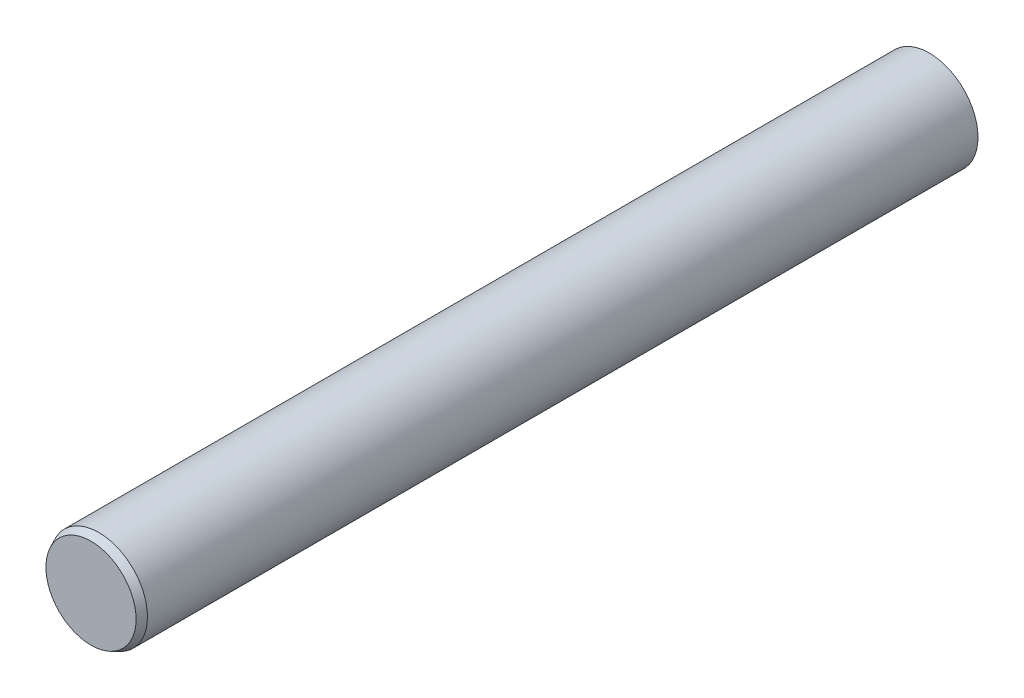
ISO-10303-21;
HEADER;
FILE_DESCRIPTION(('STEP AP214'),'2;1');
FILE_NAME('part.step','',(''),(''),'','','');
FILE_SCHEMA(('AUTOMOTIVE_DESIGN { 1 0 10303 214 1 1 1 1 }'));
ENDSEC;
DATA;
#1=APPLICATION_CONTEXT('core data for automotive mechanical design processes');
#2=APPLICATION_PROTOCOL_DEFINITION('international standard','automotive_design',2000,#1);
#3=PRODUCT_CONTEXT('',#1,'mechanical');
#4=PRODUCT('Part','Part','',(#3));
#5=PRODUCT_RELATED_PRODUCT_CATEGORY('part','',(#4));
#6=PRODUCT_DEFINITION_FORMATION('','',#4);
#7=PRODUCT_DEFINITION_CONTEXT('part definition',#1,'design');
#8=PRODUCT_DEFINITION('design','',#6,#7);
#9=PRODUCT_DEFINITION_SHAPE('','',#8);
#10=(LENGTH_UNIT() NAMED_UNIT(*) SI_UNIT(.MILLI.,.METRE.));
#11=(NAMED_UNIT(*) PLANE_ANGLE_UNIT() SI_UNIT($,.RADIAN.));
#12=(NAMED_UNIT(*) SI_UNIT($,.STERADIAN.) SOLID_ANGLE_UNIT());
#13=UNCERTAINTY_MEASURE_WITH_UNIT(LENGTH_MEASURE(1.E-05),#10,'distance_accuracy_value','');
#14=(GEOMETRIC_REPRESENTATION_CONTEXT(3) GLOBAL_UNCERTAINTY_ASSIGNED_CONTEXT((#13)) GLOBAL_UNIT_ASSIGNED_CONTEXT((#10,
#11,#12)) REPRESENTATION_CONTEXT('',''));
#15=CARTESIAN_POINT('',(0.,0.,0.));
#16=DIRECTION('',(0.,0.,1.));
#17=DIRECTION('',(1.,0.,0.));
#18=AXIS2_PLACEMENT_3D('',#15,#16,#17);
#19=CARTESIAN_POINT('',(0.,0.,20.6375));
#20=DIRECTION('',(0.,0.,-1.));
#21=DIRECTION('',(-1.,0.,0.));
#22=AXIS2_PLACEMENT_3D('',#19,#20,#21);
#23=CYLINDRICAL_SURFACE('',#22,2.3876);
#24=CARTESIAN_POINT('',(0.,0.,-20.4598367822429));
#25=DIRECTION('',(0.,0.,1.));
#26=DIRECTION('',(1.,0.,0.));
#27=AXIS2_PLACEMENT_3D('',#24,#25,#26);
#28=CIRCLE('',#27,2.3876);
#29=CARTESIAN_POINT('',(2.3876,0.,-20.4598367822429));
#30=VERTEX_POINT('',#29);
#31=EDGE_CURVE('E44',#30,#30,#28,.T.);
#32=ORIENTED_EDGE('',*,*,#31,.T.);
#33=EDGE_LOOP('',(#32));
#34=FACE_BOUND('',#33,.T.);
#35=CARTESIAN_POINT('',(0.,0.,20.2565));
#36=DIRECTION('',(0.,0.,1.));
#37=DIRECTION('',(1.,0.,0.));
#38=AXIS2_PLACEMENT_3D('',#35,#36,#37);
#39=CIRCLE('',#38,2.3876);
#40=CARTESIAN_POINT('',(2.3876,0.,20.2565));
#41=VERTEX_POINT('',#40);
#42=EDGE_CURVE('E48',#41,#41,#39,.F.);
#43=ORIENTED_EDGE('',*,*,#42,.T.);
#44=EDGE_LOOP('',(#43));
#45=FACE_BOUND('',#44,.T.);
#46=ADVANCED_FACE('F33',(#34,#45),#23,.T.);
#47=CARTESIAN_POINT('',(0.,0.,20.6375));
#48=DIRECTION('',(0.,0.,1.));
#49=DIRECTION('',(1.,0.,0.));
#50=AXIS2_PLACEMENT_3D('',#47,#48,#49);
#51=PLANE('',#50);
#52=CARTESIAN_POINT('',(0.,0.,20.6375));
#53=DIRECTION('',(0.,0.,1.));
#54=DIRECTION('',(1.,0.,0.));
#55=AXIS2_PLACEMENT_3D('',#52,#53,#54);
#56=CIRCLE('',#55,2.20993678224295);
#57=CARTESIAN_POINT('',(2.20993678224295,0.,20.6375));
#58=VERTEX_POINT('',#57);
#59=EDGE_CURVE('E10',#58,#58,#56,.T.);
#60=ORIENTED_EDGE('',*,*,#59,.T.);
#61=EDGE_LOOP('',(#60));
#62=FACE_BOUND('',#61,.T.);
#63=ADVANCED_FACE('F64',(#62),#51,.T.);
#64=CARTESIAN_POINT('',(0.,0.,-20.6375));
#65=DIRECTION('',(0.,0.,1.));
#66=DIRECTION('',(1.,0.,0.));
#67=AXIS2_PLACEMENT_3D('',#64,#65,#66);
#68=PLANE('',#67);
#69=CARTESIAN_POINT('',(0.,0.,-20.6375));
#70=DIRECTION('',(0.,0.,1.));
#71=DIRECTION('',(1.,0.,0.));
#72=AXIS2_PLACEMENT_3D('',#69,#70,#71);
#73=CIRCLE('',#72,2.00659999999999);
#74=CARTESIAN_POINT('',(2.00659999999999,0.,-20.6375));
#75=VERTEX_POINT('',#74);
#76=EDGE_CURVE('E40',#75,#75,#73,.F.);
#77=ORIENTED_EDGE('',*,*,#76,.T.);
#78=EDGE_LOOP('',(#77));
#79=FACE_BOUND('',#78,.T.);
#80=ADVANCED_FACE('F61',(#79),#68,.F.);
#81=CARTESIAN_POINT('',(0.,0.,-20.4598367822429));
#82=DIRECTION('',(0.,0.,1.));
#83=DIRECTION('',(1.,0.,0.));
#84=AXIS2_PLACEMENT_3D('',#81,#82,#83);
#85=CONICAL_SURFACE('',#84,2.3876,1.1344640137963);
#86=ORIENTED_EDGE('',*,*,#76,.F.);
#87=EDGE_LOOP('',(#86));
#88=FACE_BOUND('',#87,.T.);
#89=ORIENTED_EDGE('',*,*,#31,.F.);
#90=EDGE_LOOP('',(#89));
#91=FACE_BOUND('',#90,.T.);
#92=ADVANCED_FACE('F57',(#88,#91),#85,.T.);
#93=CARTESIAN_POINT('',(0.,0.,20.6375));
#94=DIRECTION('',(0.,0.,-1.));
#95=DIRECTION('',(-1.,0.,0.));
#96=AXIS2_PLACEMENT_3D('',#93,#94,#95);
#97=CONICAL_SURFACE('',#96,2.20993678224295,0.436332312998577);
#98=ORIENTED_EDGE('',*,*,#42,.F.);
#99=EDGE_LOOP('',(#98));
#100=FACE_BOUND('',#99,.T.);
#101=ORIENTED_EDGE('',*,*,#59,.F.);
#102=EDGE_LOOP('',(#101));
#103=FACE_BOUND('',#102,.T.);
#104=ADVANCED_FACE('F35',(#100,#103),#97,.T.);
#105=CLOSED_SHELL('',(#46,#63,#80,#92,#104));
#106=MANIFOLD_SOLID_BREP('B2',#105);
#107=ADVANCED_BREP_SHAPE_REPRESENTATION('',(#18,#106),#14);
#108=SHAPE_DEFINITION_REPRESENTATION(#9,#107);
ENDSEC;
END-ISO-10303-21;
